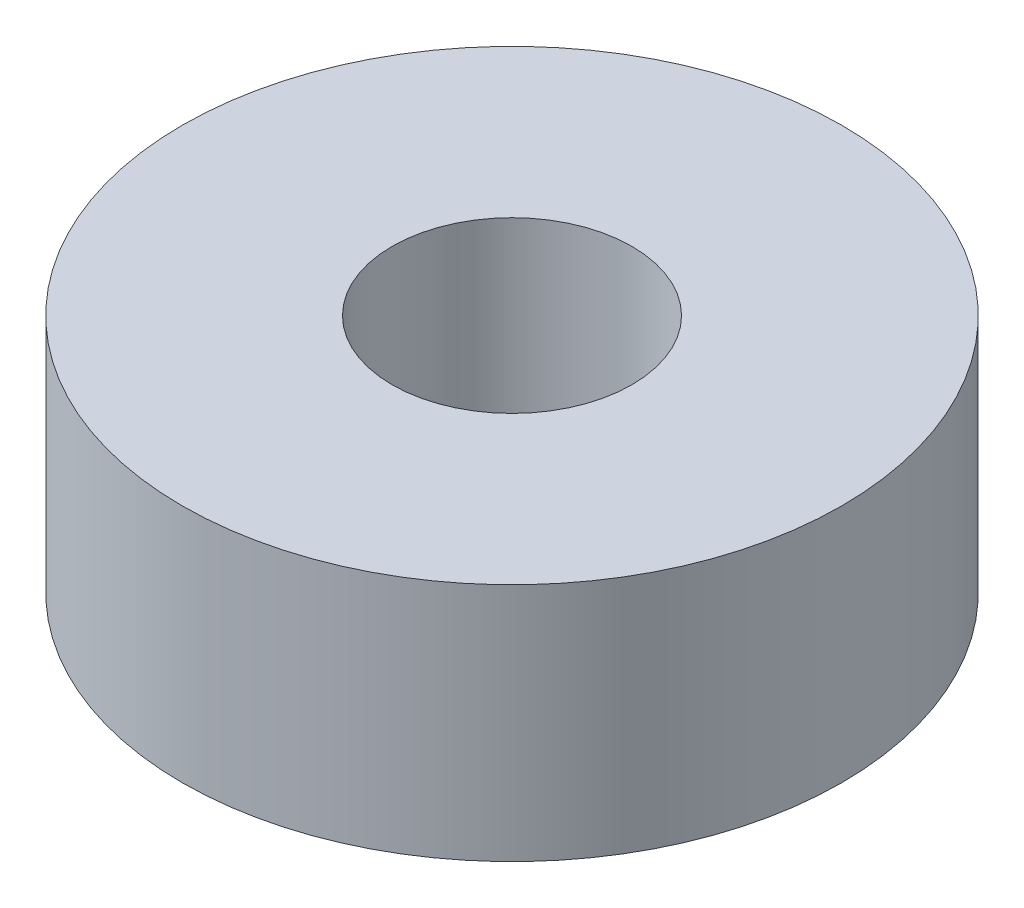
from build123d import *

# Parameters (mm, degrees)
SKETCH1_R           = 11
BOSS_EXTRUDE1_DEPTH = 8
SKETCH2_R           = 4
CUT_EXTRUDE1_DEPTH  = 18.492855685


with BuildPart() as part:
    # Sketch1 → Boss-Extrude1 (new body)
    with BuildSketch(Plane(origin=(0, 0, 0), x_dir=(1, 0, 0), z_dir=(0, 1, 0))):
        with Locations(Location((0, 0, 0), (0, 0, 270))):
            Circle(SKETCH1_R)
    extrude(amount=BOSS_EXTRUDE1_DEPTH)

    # Sketch2 → Cut-Extrude1 (cut, through all)
    with BuildSketch(Plane(origin=(0, 8, 0), x_dir=(1, 0, 0), z_dir=(0, 1, 0))):
        with Locations(Location((0, 0, 0), (0, 0, 270))):
            Circle(SKETCH2_R)
    extrude(amount=-CUT_EXTRUDE1_DEPTH, mode=Mode.SUBTRACT)


solid = part.part
